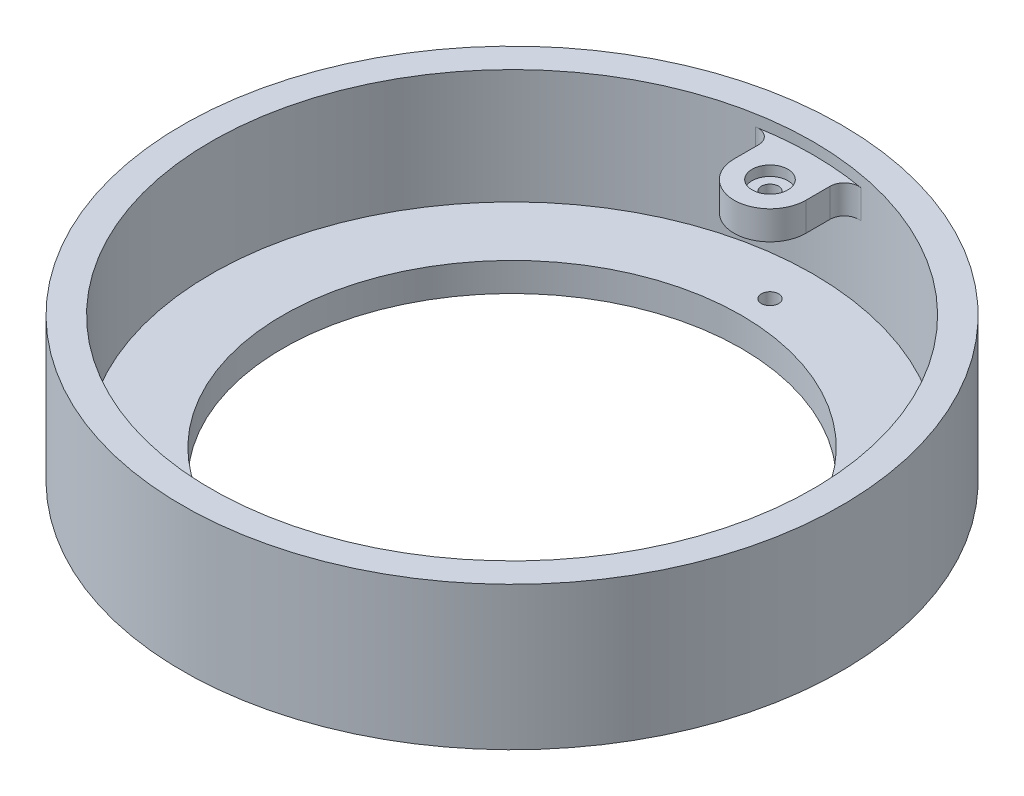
ISO-10303-21;
HEADER;
FILE_DESCRIPTION(('STEP AP214'),'2;1');
FILE_NAME('part.step','',(''),(''),'','','');
FILE_SCHEMA(('AUTOMOTIVE_DESIGN { 1 0 10303 214 1 1 1 1 }'));
ENDSEC;
DATA;
#1=APPLICATION_CONTEXT('core data for automotive mechanical design processes');
#2=APPLICATION_PROTOCOL_DEFINITION('international standard','automotive_design',2000,#1);
#3=PRODUCT_CONTEXT('',#1,'mechanical');
#4=PRODUCT('Part','Part','',(#3));
#5=PRODUCT_RELATED_PRODUCT_CATEGORY('part','',(#4));
#6=PRODUCT_DEFINITION_FORMATION('','',#4);
#7=PRODUCT_DEFINITION_CONTEXT('part definition',#1,'design');
#8=PRODUCT_DEFINITION('design','',#6,#7);
#9=PRODUCT_DEFINITION_SHAPE('','',#8);
#10=(LENGTH_UNIT() NAMED_UNIT(*) SI_UNIT(.MILLI.,.METRE.));
#11=(NAMED_UNIT(*) PLANE_ANGLE_UNIT() SI_UNIT($,.RADIAN.));
#12=(NAMED_UNIT(*) SI_UNIT($,.STERADIAN.) SOLID_ANGLE_UNIT());
#13=UNCERTAINTY_MEASURE_WITH_UNIT(LENGTH_MEASURE(1.E-05),#10,'distance_accuracy_value','');
#14=(GEOMETRIC_REPRESENTATION_CONTEXT(3) GLOBAL_UNCERTAINTY_ASSIGNED_CONTEXT((#13)) GLOBAL_UNIT_ASSIGNED_CONTEXT((#10,
#11,#12)) REPRESENTATION_CONTEXT('',''));
#15=CARTESIAN_POINT('',(0.,0.,0.));
#16=DIRECTION('',(0.,0.,1.));
#17=DIRECTION('',(1.,0.,0.));
#18=AXIS2_PLACEMENT_3D('',#15,#16,#17);
#19=CARTESIAN_POINT('',(1.89865,27.0002,-57.15));
#20=DIRECTION('',(0.,-1.,0.));
#21=DIRECTION('',(0.,0.,-1.));
#22=AXIS2_PLACEMENT_3D('',#19,#20,#21);
#23=PLANE('',#22);
#24=CARTESIAN_POINT('',(0.,27.0002,-61.11875));
#25=CARTESIAN_POINT('',(-0.75753663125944,27.0002,-61.1186487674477));
#26=CARTESIAN_POINT('',(-1.46087587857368,27.0002,-60.8400973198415));
#27=CARTESIAN_POINT('',(-1.83544331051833,27.0002,-60.6917531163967));
#28=CARTESIAN_POINT('',(-2.17173870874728,27.0002,-60.471825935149));
#29=CARTESIAN_POINT('',(-2.51614315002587,27.0002,-60.2465956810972));
#30=CARTESIAN_POINT('',(-2.80633003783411,27.0002,-59.9563300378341));
#31=CARTESIAN_POINT('',(-3.0972742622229,27.0002,-59.6653068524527));
#32=CARTESIAN_POINT('',(-3.32182593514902,27.0002,-59.3217387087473));
#33=CARTESIAN_POINT('',(-3.54223668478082,27.0002,-58.984506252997));
#34=CARTESIAN_POINT('',(-3.69009731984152,27.0002,-58.6108758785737));
#35=CARTESIAN_POINT('',(-3.96885109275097,27.0002,-57.9064904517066));
#36=CARTESIAN_POINT('',(-3.96875,27.0002,-57.15));
#37=CARTESIAN_POINT('',(-3.968648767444,27.0002,-56.3924633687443));
#38=CARTESIAN_POINT('',(-3.69009731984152,27.0002,-55.6891241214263));
#39=CARTESIAN_POINT('',(-3.54175311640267,27.0002,-55.3145566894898));
#40=CARTESIAN_POINT('',(-3.32182593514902,27.0002,-54.9782612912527));
#41=CARTESIAN_POINT('',(-3.09659568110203,27.0002,-54.6338568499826));
#42=CARTESIAN_POINT('',(-2.80633003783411,27.0002,-54.3436699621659));
#43=CARTESIAN_POINT('',(-2.51530685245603,27.0002,-54.0527257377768));
#44=CARTESIAN_POINT('',(-2.17173870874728,27.0002,-53.828174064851));
#45=CARTESIAN_POINT('',(-1.83450625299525,27.0002,-53.6077633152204));
#46=CARTESIAN_POINT('',(-1.46087587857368,27.0002,-53.4599026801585));
#47=CARTESIAN_POINT('',(-0.75700152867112,27.0002,-53.1813511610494));
#48=CARTESIAN_POINT('',(0.,27.0002,-53.18125));
#49=B_SPLINE_CURVE_WITH_KNOTS('',2,(#24,#25,#26,#27,#28,#29,#30,#31,#32,#33,#34,#35,#36,#37,#38,
#39,#40,#41,#42,#43,#44,#45,#46,#47,#48),.UNSPECIFIED.,.F.,.F.,(3,2,2,2,2,2,2,2,2,2,2,2,3),(0.,
0.125,0.1875,0.25,0.3125,0.375,0.5,0.625,0.6875,0.75,0.8125,0.875,1.),.UNSPECIFIED.);
#50=CARTESIAN_POINT('',(0.,27.0002,-61.11875));
#51=VERTEX_POINT('',#50);
#52=CARTESIAN_POINT('',(0.,27.0002,-53.18125));
#53=VERTEX_POINT('',#52);
#54=EDGE_CURVE('E147',#51,#53,#49,.T.);
#55=ORIENTED_EDGE('',*,*,#54,.T.);
#56=CARTESIAN_POINT('',(0.,27.0002,-53.18125));
#57=CARTESIAN_POINT('',(0.757536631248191,27.0002,-53.1813512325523));
#58=CARTESIAN_POINT('',(1.46087587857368,27.0002,-53.4599026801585));
#59=CARTESIAN_POINT('',(1.8354433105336,27.0002,-53.608246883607));
#60=CARTESIAN_POINT('',(2.17173870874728,27.0002,-53.828174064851));
#61=CARTESIAN_POINT('',(2.51614315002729,27.0002,-54.0534043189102));
#62=CARTESIAN_POINT('',(2.80633003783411,27.0002,-54.3436699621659));
#63=CARTESIAN_POINT('',(3.09727426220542,27.0002,-54.6346931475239));
#64=CARTESIAN_POINT('',(3.32182593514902,27.0002,-54.9782612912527));
#65=CARTESIAN_POINT('',(3.54223668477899,27.0002,-55.315493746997));
#66=CARTESIAN_POINT('',(3.69009731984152,27.0002,-55.6891241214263));
#67=CARTESIAN_POINT('',(3.96885109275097,27.0002,-56.3935095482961));
#68=CARTESIAN_POINT('',(3.96875,27.0002,-57.15));
#69=CARTESIAN_POINT('',(3.968648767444,27.0002,-57.9075366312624));
#70=CARTESIAN_POINT('',(3.69009731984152,27.0002,-58.6108758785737));
#71=CARTESIAN_POINT('',(3.54175311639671,27.0002,-58.9854433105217));
#72=CARTESIAN_POINT('',(3.32182593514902,27.0002,-59.3217387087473));
#73=CARTESIAN_POINT('',(3.09659568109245,27.0002,-59.6661431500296));
#74=CARTESIAN_POINT('',(2.80633003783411,27.0002,-59.9563300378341));
#75=CARTESIAN_POINT('',(2.51530685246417,27.0002,-60.2472742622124));
#76=CARTESIAN_POINT('',(2.17173870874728,27.0002,-60.471825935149));
#77=CARTESIAN_POINT('',(1.83450625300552,27.0002,-60.6922366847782));
#78=CARTESIAN_POINT('',(1.46087587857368,27.0002,-60.8400973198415));
#79=CARTESIAN_POINT('',(0.757001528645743,27.0002,-61.1186488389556));
#80=CARTESIAN_POINT('',(0.,27.0002,-61.11875));
#81=B_SPLINE_CURVE_WITH_KNOTS('',2,(#56,#57,#58,#59,#60,#61,#62,#63,#64,#65,#66,#67,#68,#69,#70,
#71,#72,#73,#74,#75,#76,#77,#78,#79,#80),.UNSPECIFIED.,.F.,.F.,(3,2,2,2,2,2,2,2,2,2,2,2,3),(0.,
0.125,0.1875,0.25,0.3125,0.375,0.5,0.625,0.6875,0.75,0.8125,0.875,1.),.UNSPECIFIED.);
#82=EDGE_CURVE('E466',#53,#51,#81,.T.);
#83=ORIENTED_EDGE('',*,*,#82,.T.);
#84=EDGE_LOOP('',(#55,#83));
#85=FACE_BOUND('',#84,.T.);
#86=CARTESIAN_POINT('',(0.,27.0002,-55.25135));
#87=CARTESIAN_POINT('',(-0.362678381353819,27.0002,-55.2514513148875));
#88=CARTESIAN_POINT('',(-0.698883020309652,27.0002,-55.3846574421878));
#89=CARTESIAN_POINT('',(-1.06494880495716,27.0002,-55.529694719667));
#90=CARTESIAN_POINT('',(-1.34254829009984,27.0002,-55.8074517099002));
#91=CARTESIAN_POINT('',(-1.62089275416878,27.0002,-56.0859541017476));
#92=CARTESIAN_POINT('',(-1.76534255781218,27.0002,-56.4511169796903));
#93=CARTESIAN_POINT('',(-1.89875102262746,27.0002,-56.7883678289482));
#94=CARTESIAN_POINT('',(-1.89865,27.0002,-57.15));
#95=CARTESIAN_POINT('',(-1.89854868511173,27.0002,-57.512678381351));
#96=CARTESIAN_POINT('',(-1.76534255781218,27.0002,-57.8488830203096));
#97=CARTESIAN_POINT('',(-1.6203052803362,27.0002,-58.2149488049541));
#98=CARTESIAN_POINT('',(-1.34254829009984,27.0002,-58.4925482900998));
#99=CARTESIAN_POINT('',(-1.06404589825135,27.0002,-58.7708927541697));
#100=CARTESIAN_POINT('',(-0.69888302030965,27.0002,-58.9153425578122));
#101=CARTESIAN_POINT('',(-0.362143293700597,27.0002,-59.0485488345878));
#102=CARTESIAN_POINT('',(0.,27.0002,-59.04865));
#103=B_SPLINE_CURVE_WITH_KNOTS('',2,(#86,#87,#88,#89,#90,#91,#92,#93,#94,#95,#96,#97,#98,#99,
#100,#101,#102),.UNSPECIFIED.,.F.,.F.,(3,2,2,2,2,2,2,2,3),(0.,0.125,0.25,0.375,0.5,0.625,0.75,
0.875,1.),.UNSPECIFIED.);
#104=CARTESIAN_POINT('',(0.,27.0002,-55.25135));
#105=VERTEX_POINT('',#104);
#106=CARTESIAN_POINT('',(0.,27.0002,-59.04865));
#107=VERTEX_POINT('',#106);
#108=EDGE_CURVE('E257',#105,#107,#103,.T.);
#109=ORIENTED_EDGE('',*,*,#108,.T.);
#110=CARTESIAN_POINT('',(0.,27.0002,-59.04865));
#111=CARTESIAN_POINT('',(0.362678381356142,27.0002,-59.0485486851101));
#112=CARTESIAN_POINT('',(0.698883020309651,27.0002,-58.9153425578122));
#113=CARTESIAN_POINT('',(1.06494880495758,27.0002,-58.7703052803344));
#114=CARTESIAN_POINT('',(1.34254829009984,27.0002,-58.4925482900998));
#115=CARTESIAN_POINT('',(1.62089275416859,27.0002,-58.2140458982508));
#116=CARTESIAN_POINT('',(1.76534255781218,27.0002,-57.8488830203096));
#117=CARTESIAN_POINT('',(1.89875102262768,27.0002,-57.5116321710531));
#118=CARTESIAN_POINT('',(1.89865,27.0002,-57.15));
#119=CARTESIAN_POINT('',(1.89854868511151,27.0002,-56.7873216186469));
#120=CARTESIAN_POINT('',(1.76534255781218,27.0002,-56.4511169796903));
#121=CARTESIAN_POINT('',(1.62030528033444,27.0002,-56.0850511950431));
#122=CARTESIAN_POINT('',(1.34254829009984,27.0002,-55.8074517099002));
#123=CARTESIAN_POINT('',(1.06404589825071,27.0002,-55.5291072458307));
#124=CARTESIAN_POINT('',(0.69888302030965,27.0002,-55.3846574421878));
#125=CARTESIAN_POINT('',(0.362143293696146,27.0002,-55.2514511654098));
#126=CARTESIAN_POINT('',(0.,27.0002,-55.25135));
#127=B_SPLINE_CURVE_WITH_KNOTS('',2,(#110,#111,#112,#113,#114,#115,#116,#117,#118,#119,#120,
#121,#122,#123,#124,#125,#126),.UNSPECIFIED.,.F.,.F.,(3,2,2,2,2,2,2,2,3),(0.,0.125,0.25,0.375,
0.5,0.625,0.75,0.875,1.),.UNSPECIFIED.);
#128=EDGE_CURVE('E467',#107,#105,#127,.T.);
#129=ORIENTED_EDGE('',*,*,#128,.T.);
#130=EDGE_LOOP('',(#109,#129));
#131=FACE_BOUND('',#130,.T.);
#132=ADVANCED_FACE('F15',(#85,#131),#23,.F.);
#133=CARTESIAN_POINT('',(0.,29.21,-57.15));
#134=DIRECTION('',(0.,1.,0.));
#135=DIRECTION('',(0.,0.,1.));
#136=AXIS2_PLACEMENT_3D('',#133,#134,#135);
#137=CYLINDRICAL_SURFACE('',#136,1.89865);
#138=CARTESIAN_POINT('',(0.,22.86,-57.15));
#139=DIRECTION('',(0.,-1.,0.));
#140=DIRECTION('',(0.,0.,-1.));
#141=AXIS2_PLACEMENT_3D('',#138,#139,#140);
#142=CIRCLE('',#141,1.89864999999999);
#143=CARTESIAN_POINT('',(0.,22.86,-59.04865));
#144=VERTEX_POINT('',#143);
#145=CARTESIAN_POINT('',(0.,22.86,-55.25135));
#146=VERTEX_POINT('',#145);
#147=EDGE_CURVE('E279',#144,#146,#142,.T.);
#148=ORIENTED_EDGE('',*,*,#147,.T.);
#149=CARTESIAN_POINT('',(0.,22.86,-57.15));
#150=DIRECTION('',(0.,-1.,0.));
#151=DIRECTION('',(0.,0.,1.));
#152=AXIS2_PLACEMENT_3D('',#149,#150,#151);
#153=CIRCLE('',#152,1.89864999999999);
#154=EDGE_CURVE('E271',#146,#144,#153,.T.);
#155=ORIENTED_EDGE('',*,*,#154,.T.);
#156=EDGE_LOOP('',(#148,#155));
#157=FACE_BOUND('',#156,.T.);
#158=ORIENTED_EDGE('',*,*,#108,.F.);
#159=ORIENTED_EDGE('',*,*,#128,.F.);
#160=EDGE_LOOP('',(#158,#159));
#161=FACE_BOUND('',#160,.T.);
#162=ADVANCED_FACE('F239',(#157,#161),#137,.F.);
#163=CARTESIAN_POINT('',(0.,29.21,-57.15));
#164=DIRECTION('',(0.,1.,0.));
#165=DIRECTION('',(0.,0.,1.));
#166=AXIS2_PLACEMENT_3D('',#163,#164,#165);
#167=CYLINDRICAL_SURFACE('',#166,3.96875);
#168=CARTESIAN_POINT('',(0.,29.21,-57.15));
#169=DIRECTION('',(0.,1.,0.));
#170=DIRECTION('',(0.,0.,1.));
#171=AXIS2_PLACEMENT_3D('',#168,#169,#170);
#172=CIRCLE('',#171,3.96875);
#173=CARTESIAN_POINT('',(0.,29.21,-53.18125));
#174=VERTEX_POINT('',#173);
#175=EDGE_CURVE('E367',#174,#174,#172,.F.);
#176=ORIENTED_EDGE('',*,*,#175,.F.);
#177=EDGE_LOOP('',(#176));
#178=FACE_BOUND('',#177,.T.);
#179=ORIENTED_EDGE('',*,*,#54,.F.);
#180=ORIENTED_EDGE('',*,*,#82,.F.);
#181=EDGE_LOOP('',(#179,#180));
#182=FACE_BOUND('',#181,.T.);
#183=ADVANCED_FACE('F228',(#178,#182),#167,.F.);
#184=CARTESIAN_POINT('',(-7.9375,22.86,-57.15));
#185=DIRECTION('',(1.,0.,0.));
#186=DIRECTION('',(0.,0.,-1.));
#187=AXIS2_PLACEMENT_3D('',#184,#185,#186);
#188=PLANE('',#187);
#189=DIRECTION('',(0.,1.,0.));
#190=VECTOR('',#189,1.);
#191=CARTESIAN_POINT('',(-7.9375,22.86,-62.5200955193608));
#192=LINE('',#191,#190);
#193=CARTESIAN_POINT('',(-7.9375,22.86,-62.5200955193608));
#194=VERTEX_POINT('',#193);
#195=CARTESIAN_POINT('',(-7.9375,29.21,-62.5200955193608));
#196=VERTEX_POINT('',#195);
#197=EDGE_CURVE('E143',#194,#196,#192,.T.);
#198=ORIENTED_EDGE('',*,*,#197,.F.);
#199=DIRECTION('',(0.,0.,1.));
#200=VECTOR('',#199,1.);
#201=CARTESIAN_POINT('',(-7.9375,22.86,0.));
#202=LINE('',#201,#200);
#203=CARTESIAN_POINT('',(-7.9375,22.86,-57.15));
#204=VERTEX_POINT('',#203);
#205=EDGE_CURVE('E386',#194,#204,#202,.T.);
#206=ORIENTED_EDGE('',*,*,#205,.T.);
#207=DIRECTION('',(0.,1.,0.));
#208=VECTOR('',#207,1.);
#209=CARTESIAN_POINT('',(-7.9375,22.86,-57.15));
#210=LINE('',#209,#208);
#211=CARTESIAN_POINT('',(-7.9375,29.21,-57.15));
#212=VERTEX_POINT('',#211);
#213=EDGE_CURVE('E139',#212,#204,#210,.F.);
#214=ORIENTED_EDGE('',*,*,#213,.F.);
#215=DIRECTION('',(0.,0.,1.));
#216=VECTOR('',#215,1.);
#217=CARTESIAN_POINT('',(-7.9375,29.21,0.));
#218=LINE('',#217,#216);
#219=EDGE_CURVE('E127',#196,#212,#218,.T.);
#220=ORIENTED_EDGE('',*,*,#219,.F.);
#221=EDGE_LOOP('',(#198,#206,#214,#220));
#222=FACE_BOUND('',#221,.T.);
#223=ADVANCED_FACE('F238',(#222),#188,.F.);
#224=CARTESIAN_POINT('',(0.,22.86,-57.15));
#225=DIRECTION('',(0.,1.,0.));
#226=DIRECTION('',(0.,0.,1.));
#227=AXIS2_PLACEMENT_3D('',#224,#225,#226);
#228=CYLINDRICAL_SURFACE('',#227,7.9375);
#229=DIRECTION('',(0.,1.,0.));
#230=VECTOR('',#229,1.);
#231=CARTESIAN_POINT('',(7.9375,22.86,-57.15));
#232=LINE('',#231,#230);
#233=CARTESIAN_POINT('',(7.9375,22.86,-57.15));
#234=VERTEX_POINT('',#233);
#235=CARTESIAN_POINT('',(7.9375,29.21,-57.15));
#236=VERTEX_POINT('',#235);
#237=EDGE_CURVE('E134',#234,#236,#232,.T.);
#238=ORIENTED_EDGE('',*,*,#237,.T.);
#239=CARTESIAN_POINT('',(0.,29.21,-57.15));
#240=DIRECTION('',(0.,1.,0.));
#241=DIRECTION('',(0.,0.,1.));
#242=AXIS2_PLACEMENT_3D('',#239,#240,#241);
#243=CIRCLE('',#242,7.9375);
#244=EDGE_CURVE('E364',#212,#236,#243,.T.);
#245=ORIENTED_EDGE('',*,*,#244,.F.);
#246=ORIENTED_EDGE('',*,*,#213,.T.);
#247=CARTESIAN_POINT('',(0.,22.86,-57.15));
#248=DIRECTION('',(0.,1.,0.));
#249=DIRECTION('',(-1.,0.,0.));
#250=AXIS2_PLACEMENT_3D('',#247,#248,#249);
#251=CIRCLE('',#250,7.9375);
#252=CARTESIAN_POINT('',(0.,22.86,-49.2125));
#253=VERTEX_POINT('',#252);
#254=EDGE_CURVE('E378',#204,#253,#251,.T.);
#255=ORIENTED_EDGE('',*,*,#254,.T.);
#256=CARTESIAN_POINT('',(0.,22.86,-57.15));
#257=DIRECTION('',(0.,1.,0.));
#258=DIRECTION('',(0.,0.,1.));
#259=AXIS2_PLACEMENT_3D('',#256,#257,#258);
#260=CIRCLE('',#259,7.9375);
#261=EDGE_CURVE('E375',#253,#234,#260,.T.);
#262=ORIENTED_EDGE('',*,*,#261,.T.);
#263=EDGE_LOOP('',(#238,#245,#246,#255,#262));
#264=FACE_BOUND('',#263,.T.);
#265=ADVANCED_FACE('F302',(#264),#228,.T.);
#266=CARTESIAN_POINT('',(7.9375,22.86,-66.2008437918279));
#267=DIRECTION('',(-1.,0.,0.));
#268=DIRECTION('',(0.,0.,1.));
#269=AXIS2_PLACEMENT_3D('',#266,#267,#268);
#270=PLANE('',#269);
#271=DIRECTION('',(0.,-1.,0.));
#272=VECTOR('',#271,1.);
#273=CARTESIAN_POINT('',(7.9375,31.75,-62.5200955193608));
#274=LINE('',#273,#272);
#275=CARTESIAN_POINT('',(7.9375,22.86,-62.5200955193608));
#276=VERTEX_POINT('',#275);
#277=CARTESIAN_POINT('',(7.9375,29.21,-62.5200955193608));
#278=VERTEX_POINT('',#277);
#279=EDGE_CURVE('E131',#276,#278,#274,.F.);
#280=ORIENTED_EDGE('',*,*,#279,.T.);
#281=DIRECTION('',(0.,0.,1.));
#282=VECTOR('',#281,1.);
#283=CARTESIAN_POINT('',(7.9375,29.21,0.));
#284=LINE('',#283,#282);
#285=EDGE_CURVE('E117',#236,#278,#284,.F.);
#286=ORIENTED_EDGE('',*,*,#285,.F.);
#287=ORIENTED_EDGE('',*,*,#237,.F.);
#288=DIRECTION('',(0.,0.,1.));
#289=VECTOR('',#288,1.);
#290=CARTESIAN_POINT('',(7.9375,22.86,0.));
#291=LINE('',#290,#289);
#292=EDGE_CURVE('E372',#234,#276,#291,.F.);
#293=ORIENTED_EDGE('',*,*,#292,.T.);
#294=EDGE_LOOP('',(#280,#286,#287,#293));
#295=FACE_BOUND('',#294,.T.);
#296=ADVANCED_FACE('F199',(#295),#270,.F.);
#297=CARTESIAN_POINT('',(-11.1125,31.75,-62.5200955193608));
#298=DIRECTION('',(0.,-1.,0.));
#299=DIRECTION('',(0.,0.,-1.));
#300=AXIS2_PLACEMENT_3D('',#297,#298,#299);
#301=CYLINDRICAL_SURFACE('',#300,3.175);
#302=CARTESIAN_POINT('',(0.,29.21,0.));
#303=DIRECTION('',(0.,-1.,0.));
#304=DIRECTION('',(-0.175,0.,-0.984568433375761));
#305=AXIS2_PLACEMENT_3D('',#302,#303,#304);
#306=CIRCLE('',#305,66.675);
#307=CARTESIAN_POINT('',(-11.668125,29.21,-65.6461002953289));
#308=VERTEX_POINT('',#307);
#309=CARTESIAN_POINT('',(-11.1163929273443,29.21,-65.7181098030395));
#310=VERTEX_POINT('',#309);
#311=EDGE_CURVE('E109',#308,#310,#306,.T.);
#312=ORIENTED_EDGE('',*,*,#311,.F.);
#313=DIRECTION('',(0.,-1.,0.));
#314=VECTOR('',#313,1.);
#315=CARTESIAN_POINT('',(-11.668125,31.75,-65.6461002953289));
#316=LINE('',#315,#314);
#317=CARTESIAN_POINT('',(-11.668125,22.86,-65.6461002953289));
#318=VERTEX_POINT('',#317);
#319=EDGE_CURVE('E119',#308,#318,#316,.T.);
#320=ORIENTED_EDGE('',*,*,#319,.T.);
#321=CARTESIAN_POINT('',(0.,22.86,0.));
#322=DIRECTION('',(0.,1.,0.));
#323=DIRECTION('',(-0.166783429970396,0.,-0.985993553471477));
#324=AXIS2_PLACEMENT_3D('',#321,#322,#323);
#325=CIRCLE('',#324,66.675);
#326=CARTESIAN_POINT('',(-11.1163929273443,22.86,-65.7181098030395));
#327=VERTEX_POINT('',#326);
#328=EDGE_CURVE('E133',#327,#318,#325,.T.);
#329=ORIENTED_EDGE('',*,*,#328,.F.);
#330=CARTESIAN_POINT('',(-11.1125,22.86,-62.5200955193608));
#331=DIRECTION('',(0.,-1.,0.));
#332=DIRECTION('',(0.,0.,-1.));
#333=AXIS2_PLACEMENT_3D('',#330,#331,#332);
#334=CIRCLE('',#333,3.175);
#335=EDGE_CURVE('E184',#327,#194,#334,.T.);
#336=ORIENTED_EDGE('',*,*,#335,.T.);
#337=ORIENTED_EDGE('',*,*,#197,.T.);
#338=CARTESIAN_POINT('',(-11.1125,29.21,-62.5200955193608));
#339=DIRECTION('',(0.,-1.,0.));
#340=DIRECTION('',(0.,0.,-1.));
#341=AXIS2_PLACEMENT_3D('',#338,#339,#340);
#342=CIRCLE('',#341,3.175);
#343=EDGE_CURVE('E98',#310,#196,#342,.T.);
#344=ORIENTED_EDGE('',*,*,#343,.F.);
#345=EDGE_LOOP('',(#312,#320,#329,#336,#337,#344));
#346=FACE_BOUND('',#345,.T.);
#347=ADVANCED_FACE('F190',(#346),#301,.F.);
#348=CARTESIAN_POINT('',(0.,22.86,0.));
#349=DIRECTION('',(0.,1.,0.));
#350=DIRECTION('',(0.,0.,1.));
#351=AXIS2_PLACEMENT_3D('',#348,#349,#350);
#352=PLANE('',#351);
#353=CARTESIAN_POINT('',(11.1125,22.86,-62.5200955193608));
#354=DIRECTION('',(0.,-1.,0.));
#355=DIRECTION('',(-1.,0.,0.));
#356=AXIS2_PLACEMENT_3D('',#353,#354,#355);
#357=CIRCLE('',#356,3.175);
#358=CARTESIAN_POINT('',(11.1163929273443,22.86,-65.7181098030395));
#359=VERTEX_POINT('',#358);
#360=EDGE_CURVE('E371',#276,#359,#357,.T.);
#361=ORIENTED_EDGE('',*,*,#360,.F.);
#362=ORIENTED_EDGE('',*,*,#292,.F.);
#363=ORIENTED_EDGE('',*,*,#261,.F.);
#364=ORIENTED_EDGE('',*,*,#254,.F.);
#365=ORIENTED_EDGE('',*,*,#205,.F.);
#366=ORIENTED_EDGE('',*,*,#335,.F.);
#367=CARTESIAN_POINT('',(0.,22.86,0.));
#368=DIRECTION('',(0.,-1.,0.));
#369=DIRECTION('',(0.,0.,-1.));
#370=AXIS2_PLACEMENT_3D('',#367,#368,#369);
#371=CIRCLE('',#370,66.675);
#372=EDGE_CURVE('E122',#327,#359,#371,.T.);
#373=ORIENTED_EDGE('',*,*,#372,.T.);
#374=EDGE_LOOP('',(#361,#362,#363,#364,#365,#366,#373));
#375=FACE_BOUND('',#374,.T.);
#376=ORIENTED_EDGE('',*,*,#154,.F.);
#377=ORIENTED_EDGE('',*,*,#147,.F.);
#378=EDGE_LOOP('',(#376,#377));
#379=FACE_BOUND('',#378,.T.);
#380=ADVANCED_FACE('F164',(#375,#379),#352,.F.);
#381=CARTESIAN_POINT('',(11.1125,31.75,-62.5200955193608));
#382=DIRECTION('',(0.,-1.,0.));
#383=DIRECTION('',(0.,0.,-1.));
#384=AXIS2_PLACEMENT_3D('',#381,#382,#383);
#385=CYLINDRICAL_SURFACE('',#384,3.175);
#386=CARTESIAN_POINT('',(11.1125,29.21,-62.5200955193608));
#387=DIRECTION('',(0.,-1.,0.));
#388=DIRECTION('',(0.,0.,-1.));
#389=AXIS2_PLACEMENT_3D('',#386,#387,#388);
#390=CIRCLE('',#389,3.175);
#391=CARTESIAN_POINT('',(11.668125,29.21,-65.6461002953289));
#392=VERTEX_POINT('',#391);
#393=EDGE_CURVE('E113',#278,#392,#390,.T.);
#394=ORIENTED_EDGE('',*,*,#393,.F.);
#395=ORIENTED_EDGE('',*,*,#279,.F.);
#396=ORIENTED_EDGE('',*,*,#360,.T.);
#397=CARTESIAN_POINT('',(0.,22.86,0.));
#398=DIRECTION('',(0.,1.,0.));
#399=DIRECTION('',(0.175,0.,-0.984568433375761));
#400=AXIS2_PLACEMENT_3D('',#397,#398,#399);
#401=CIRCLE('',#400,66.675);
#402=CARTESIAN_POINT('',(11.668125,22.86,-65.6461002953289));
#403=VERTEX_POINT('',#402);
#404=EDGE_CURVE('E34',#403,#359,#401,.T.);
#405=ORIENTED_EDGE('',*,*,#404,.F.);
#406=DIRECTION('',(0.,-1.,0.));
#407=VECTOR('',#406,1.);
#408=CARTESIAN_POINT('',(11.668125,31.75,-65.6461002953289));
#409=LINE('',#408,#407);
#410=EDGE_CURVE('E107',#403,#392,#409,.F.);
#411=ORIENTED_EDGE('',*,*,#410,.T.);
#412=EDGE_LOOP('',(#394,#395,#396,#405,#411));
#413=FACE_BOUND('',#412,.T.);
#414=ADVANCED_FACE('F121',(#413),#385,.F.);
#415=CARTESIAN_POINT('',(0.,29.21,0.));
#416=DIRECTION('',(0.,1.,0.));
#417=DIRECTION('',(0.,0.,1.));
#418=AXIS2_PLACEMENT_3D('',#415,#416,#417);
#419=PLANE('',#418);
#420=ORIENTED_EDGE('',*,*,#285,.T.);
#421=ORIENTED_EDGE('',*,*,#393,.T.);
#422=CARTESIAN_POINT('',(0.,29.21,0.));
#423=DIRECTION('',(0.,-1.,0.));
#424=DIRECTION('',(0.,0.,-1.));
#425=AXIS2_PLACEMENT_3D('',#422,#423,#424);
#426=CIRCLE('',#425,66.675);
#427=EDGE_CURVE('E103',#392,#310,#426,.F.);
#428=ORIENTED_EDGE('',*,*,#427,.T.);
#429=ORIENTED_EDGE('',*,*,#343,.T.);
#430=ORIENTED_EDGE('',*,*,#219,.T.);
#431=ORIENTED_EDGE('',*,*,#244,.T.);
#432=EDGE_LOOP('',(#420,#421,#428,#429,#430,#431));
#433=FACE_BOUND('',#432,.T.);
#434=ORIENTED_EDGE('',*,*,#175,.T.);
#435=EDGE_LOOP('',(#434));
#436=FACE_BOUND('',#435,.T.);
#437=ADVANCED_FACE('F114',(#433,#436),#419,.T.);
#438=CARTESIAN_POINT('',(0.,31.75,0.));
#439=DIRECTION('',(0.,-1.,0.));
#440=DIRECTION('',(0.,0.,-1.));
#441=AXIS2_PLACEMENT_3D('',#438,#439,#440);
#442=CYLINDRICAL_SURFACE('',#441,66.675);
#443=ORIENTED_EDGE('',*,*,#404,.T.);
#444=ORIENTED_EDGE('',*,*,#372,.F.);
#445=ORIENTED_EDGE('',*,*,#328,.T.);
#446=ORIENTED_EDGE('',*,*,#319,.F.);
#447=ORIENTED_EDGE('',*,*,#311,.T.);
#448=ORIENTED_EDGE('',*,*,#427,.F.);
#449=ORIENTED_EDGE('',*,*,#410,.F.);
#450=EDGE_LOOP('',(#443,#444,#445,#446,#447,#448,#449));
#451=FACE_BOUND('',#450,.T.);
#452=CARTESIAN_POINT('',(0.,31.75,0.));
#453=DIRECTION('',(0.,-1.,0.));
#454=DIRECTION('',(0.,0.,-1.));
#455=AXIS2_PLACEMENT_3D('',#452,#453,#454);
#456=CIRCLE('',#455,66.675);
#457=CARTESIAN_POINT('',(0.,31.75,-66.675));
#458=VERTEX_POINT('',#457);
#459=EDGE_CURVE('E357',#458,#458,#456,.T.);
#460=ORIENTED_EDGE('',*,*,#459,.F.);
#461=EDGE_LOOP('',(#460));
#462=FACE_BOUND('',#461,.T.);
#463=CARTESIAN_POINT('',(0.,6.35,0.));
#464=DIRECTION('',(0.,-1.,0.));
#465=DIRECTION('',(0.,0.,-1.));
#466=AXIS2_PLACEMENT_3D('',#463,#464,#465);
#467=CIRCLE('',#466,66.675);
#468=CARTESIAN_POINT('',(0.,6.35,-66.675));
#469=VERTEX_POINT('',#468);
#470=EDGE_CURVE('E111',#469,#469,#467,.F.);
#471=ORIENTED_EDGE('',*,*,#470,.F.);
#472=EDGE_LOOP('',(#471));
#473=FACE_BOUND('',#472,.T.);
#474=ADVANCED_FACE('F105',(#451,#462,#473),#442,.F.);
#475=CARTESIAN_POINT('',(0.,6.35,0.));
#476=DIRECTION('',(0.,1.,0.));
#477=DIRECTION('',(0.,0.,1.));
#478=AXIS2_PLACEMENT_3D('',#475,#476,#477);
#479=PLANE('',#478);
#480=ORIENTED_EDGE('',*,*,#470,.T.);
#481=EDGE_LOOP('',(#480));
#482=FACE_BOUND('',#481,.T.);
#483=CARTESIAN_POINT('',(0.,6.35,0.));
#484=DIRECTION('',(0.,1.,0.));
#485=DIRECTION('',(0.,0.,1.));
#486=AXIS2_PLACEMENT_3D('',#483,#484,#485);
#487=CIRCLE('',#486,50.8);
#488=CARTESIAN_POINT('',(0.,6.35,50.8));
#489=VERTEX_POINT('',#488);
#490=EDGE_CURVE('E349',#489,#489,#487,.F.);
#491=ORIENTED_EDGE('',*,*,#490,.T.);
#492=EDGE_LOOP('',(#491));
#493=FACE_BOUND('',#492,.T.);
#494=CARTESIAN_POINT('',(0.,6.35,-57.15));
#495=DIRECTION('',(0.,1.,0.));
#496=DIRECTION('',(0.,0.,1.));
#497=AXIS2_PLACEMENT_3D('',#494,#495,#496);
#498=CIRCLE('',#497,1.89865);
#499=CARTESIAN_POINT('',(0.,6.35,-55.25135));
#500=VERTEX_POINT('',#499);
#501=EDGE_CURVE('E354',#500,#500,#498,.F.);
#502=ORIENTED_EDGE('',*,*,#501,.T.);
#503=EDGE_LOOP('',(#502));
#504=FACE_BOUND('',#503,.T.);
#505=ADVANCED_FACE('F519',(#482,#493,#504),#479,.T.);
#506=CARTESIAN_POINT('',(0.,31.75,0.));
#507=DIRECTION('',(0.,1.,0.));
#508=DIRECTION('',(0.,0.,1.));
#509=AXIS2_PLACEMENT_3D('',#506,#507,#508);
#510=PLANE('',#509);
#511=CARTESIAN_POINT('',(0.,31.75,0.));
#512=DIRECTION('',(0.,-1.,0.));
#513=DIRECTION('',(0.,0.,-1.));
#514=AXIS2_PLACEMENT_3D('',#511,#512,#513);
#515=CIRCLE('',#514,73.025);
#516=CARTESIAN_POINT('',(0.,31.75,-73.025));
#517=VERTEX_POINT('',#516);
#518=EDGE_CURVE('E345',#517,#517,#515,.T.);
#519=ORIENTED_EDGE('',*,*,#518,.F.);
#520=EDGE_LOOP('',(#519));
#521=FACE_BOUND('',#520,.T.);
#522=ORIENTED_EDGE('',*,*,#459,.T.);
#523=EDGE_LOOP('',(#522));
#524=FACE_BOUND('',#523,.T.);
#525=ADVANCED_FACE('F512',(#521,#524),#510,.T.);
#526=CARTESIAN_POINT('',(0.,29.21,-57.15));
#527=DIRECTION('',(0.,1.,0.));
#528=DIRECTION('',(0.,0.,1.));
#529=AXIS2_PLACEMENT_3D('',#526,#527,#528);
#530=CYLINDRICAL_SURFACE('',#529,1.89865);
#531=CARTESIAN_POINT('',(0.,0.,-57.15));
#532=DIRECTION('',(0.,1.,0.));
#533=DIRECTION('',(0.,0.,1.));
#534=AXIS2_PLACEMENT_3D('',#531,#532,#533);
#535=CIRCLE('',#534,1.89865);
#536=CARTESIAN_POINT('',(0.,0.,-55.25135));
#537=VERTEX_POINT('',#536);
#538=EDGE_CURVE('E343',#537,#537,#535,.F.);
#539=ORIENTED_EDGE('',*,*,#538,.T.);
#540=EDGE_LOOP('',(#539));
#541=FACE_BOUND('',#540,.T.);
#542=ORIENTED_EDGE('',*,*,#501,.F.);
#543=EDGE_LOOP('',(#542));
#544=FACE_BOUND('',#543,.T.);
#545=ADVANCED_FACE('F504',(#541,#544),#530,.F.);
#546=CARTESIAN_POINT('',(0.,0.,0.));
#547=DIRECTION('',(0.,1.,0.));
#548=DIRECTION('',(0.,0.,1.));
#549=AXIS2_PLACEMENT_3D('',#546,#547,#548);
#550=CYLINDRICAL_SURFACE('',#549,50.8);
#551=CARTESIAN_POINT('',(0.,0.,0.));
#552=DIRECTION('',(0.,1.,0.));
#553=DIRECTION('',(0.,0.,1.));
#554=AXIS2_PLACEMENT_3D('',#551,#552,#553);
#555=CIRCLE('',#554,50.8);
#556=CARTESIAN_POINT('',(0.,0.,50.8));
#557=VERTEX_POINT('',#556);
#558=EDGE_CURVE('E25',#557,#557,#555,.F.);
#559=ORIENTED_EDGE('',*,*,#558,.T.);
#560=EDGE_LOOP('',(#559));
#561=FACE_BOUND('',#560,.T.);
#562=ORIENTED_EDGE('',*,*,#490,.F.);
#563=EDGE_LOOP('',(#562));
#564=FACE_BOUND('',#563,.T.);
#565=ADVANCED_FACE('F334',(#561,#564),#550,.F.);
#566=CARTESIAN_POINT('',(0.,31.75,0.));
#567=DIRECTION('',(0.,-1.,0.));
#568=DIRECTION('',(0.,0.,-1.));
#569=AXIS2_PLACEMENT_3D('',#566,#567,#568);
#570=CYLINDRICAL_SURFACE('',#569,73.025);
#571=ORIENTED_EDGE('',*,*,#518,.T.);
#572=EDGE_LOOP('',(#571));
#573=FACE_BOUND('',#572,.T.);
#574=CARTESIAN_POINT('',(0.,0.,0.));
#575=DIRECTION('',(0.,-1.,0.));
#576=DIRECTION('',(0.,0.,-1.));
#577=AXIS2_PLACEMENT_3D('',#574,#575,#576);
#578=CIRCLE('',#577,73.025);
#579=CARTESIAN_POINT('',(0.,0.,-73.025));
#580=VERTEX_POINT('',#579);
#581=EDGE_CURVE('E10',#580,#580,#578,.F.);
#582=ORIENTED_EDGE('',*,*,#581,.T.);
#583=EDGE_LOOP('',(#582));
#584=FACE_BOUND('',#583,.T.);
#585=ADVANCED_FACE('F328',(#573,#584),#570,.T.);
#586=CARTESIAN_POINT('',(0.,0.,0.));
#587=DIRECTION('',(0.,1.,0.));
#588=DIRECTION('',(0.,0.,1.));
#589=AXIS2_PLACEMENT_3D('',#586,#587,#588);
#590=PLANE('',#589);
#591=ORIENTED_EDGE('',*,*,#581,.F.);
#592=EDGE_LOOP('',(#591));
#593=FACE_BOUND('',#592,.T.);
#594=ORIENTED_EDGE('',*,*,#558,.F.);
#595=EDGE_LOOP('',(#594));
#596=FACE_BOUND('',#595,.T.);
#597=ORIENTED_EDGE('',*,*,#538,.F.);
#598=EDGE_LOOP('',(#597));
#599=FACE_BOUND('',#598,.T.);
#600=ADVANCED_FACE('F17',(#593,#596,#599),#590,.F.);
#601=CLOSED_SHELL('',(#132,#162,#183,#223,#265,#296,#347,#380,#414,#437,#474,#505,#525,#545,
#565,#585,#600));
#602=MANIFOLD_SOLID_BREP('B1',#601);
#603=ADVANCED_BREP_SHAPE_REPRESENTATION('',(#18,#602),#14);
#604=SHAPE_DEFINITION_REPRESENTATION(#9,#603);
ENDSEC;
END-ISO-10303-21;
